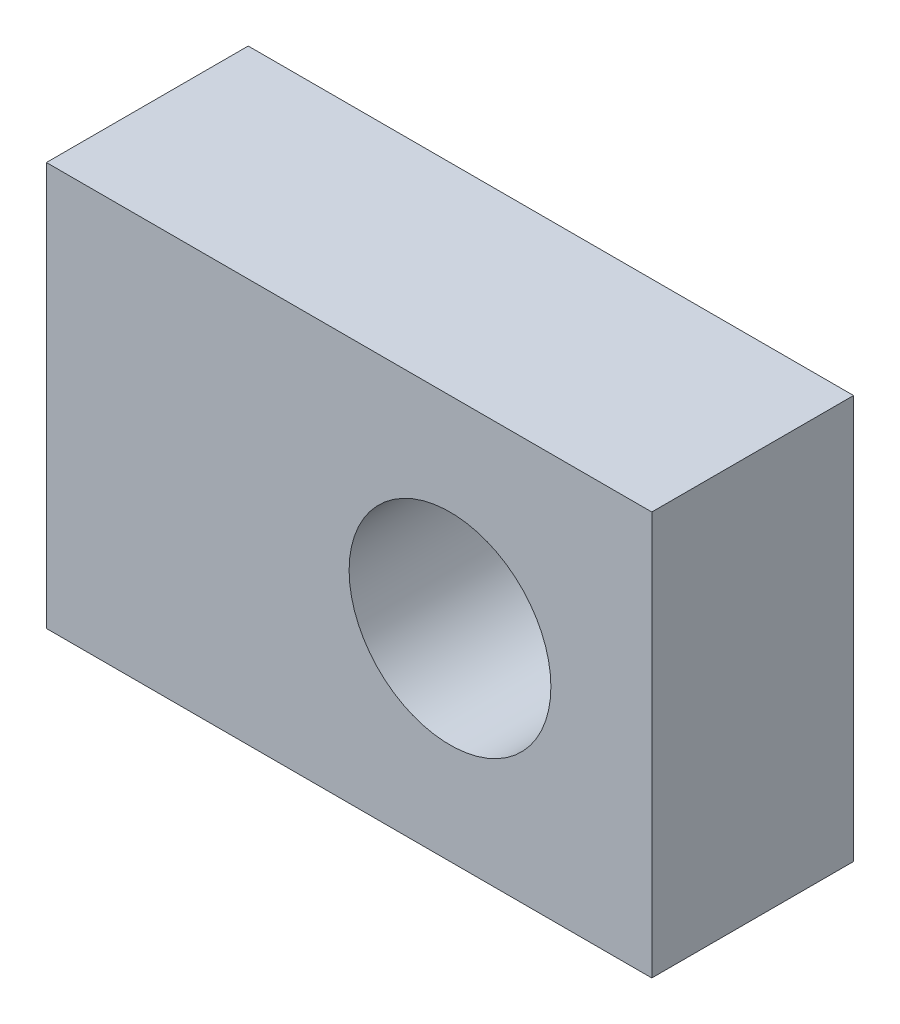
ISO-10303-21;
HEADER;
FILE_DESCRIPTION(('STEP AP214'),'2;1');
FILE_NAME('part.step','',(''),(''),'','','');
FILE_SCHEMA(('AUTOMOTIVE_DESIGN { 1 0 10303 214 1 1 1 1 }'));
ENDSEC;
DATA;
#1=APPLICATION_CONTEXT('core data for automotive mechanical design processes');
#2=APPLICATION_PROTOCOL_DEFINITION('international standard','automotive_design',2000,#1);
#3=PRODUCT_CONTEXT('',#1,'mechanical');
#4=PRODUCT('Part','Part','',(#3));
#5=PRODUCT_RELATED_PRODUCT_CATEGORY('part','',(#4));
#6=PRODUCT_DEFINITION_FORMATION('','',#4);
#7=PRODUCT_DEFINITION_CONTEXT('part definition',#1,'design');
#8=PRODUCT_DEFINITION('design','',#6,#7);
#9=PRODUCT_DEFINITION_SHAPE('','',#8);
#10=(LENGTH_UNIT() NAMED_UNIT(*) SI_UNIT(.MILLI.,.METRE.));
#11=(NAMED_UNIT(*) PLANE_ANGLE_UNIT() SI_UNIT($,.RADIAN.));
#12=(NAMED_UNIT(*) SI_UNIT($,.STERADIAN.) SOLID_ANGLE_UNIT());
#13=UNCERTAINTY_MEASURE_WITH_UNIT(LENGTH_MEASURE(1.E-05),#10,'distance_accuracy_value','');
#14=(GEOMETRIC_REPRESENTATION_CONTEXT(3) GLOBAL_UNCERTAINTY_ASSIGNED_CONTEXT((#13)) GLOBAL_UNIT_ASSIGNED_CONTEXT((#10,
#11,#12)) REPRESENTATION_CONTEXT('',''));
#15=CARTESIAN_POINT('',(0.,0.,0.));
#16=DIRECTION('',(0.,0.,1.));
#17=DIRECTION('',(1.,0.,0.));
#18=AXIS2_PLACEMENT_3D('',#15,#16,#17);
#19=CARTESIAN_POINT('',(10.865660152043,-8.20939430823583,12.7));
#20=DIRECTION('',(0.,0.,1.));
#21=DIRECTION('',(1.,0.,0.));
#22=AXIS2_PLACEMENT_3D('',#19,#20,#21);
#23=PLANE('',#22);
#24=DIRECTION('',(0.,-1.,0.));
#25=VECTOR('',#24,1.);
#26=CARTESIAN_POINT('',(10.865660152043,17.1906056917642,12.7));
#27=LINE('',#26,#25);
#28=CARTESIAN_POINT('',(10.865660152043,17.1906056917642,12.7));
#29=VERTEX_POINT('',#28);
#30=CARTESIAN_POINT('',(10.865660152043,-8.20939430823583,12.7));
#31=VERTEX_POINT('',#30);
#32=EDGE_CURVE('E83',#29,#31,#27,.T.);
#33=ORIENTED_EDGE('',*,*,#32,.T.);
#34=DIRECTION('',(1.,0.,0.));
#35=VECTOR('',#34,1.);
#36=CARTESIAN_POINT('',(10.865660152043,-8.20939430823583,12.7));
#37=LINE('',#36,#35);
#38=CARTESIAN_POINT('',(48.965660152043,-8.20939430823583,12.7));
#39=VERTEX_POINT('',#38);
#40=EDGE_CURVE('E78',#31,#39,#37,.T.);
#41=ORIENTED_EDGE('',*,*,#40,.T.);
#42=DIRECTION('',(0.,1.,0.));
#43=VECTOR('',#42,1.);
#44=CARTESIAN_POINT('',(48.965660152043,17.1906056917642,12.7));
#45=LINE('',#44,#43);
#46=CARTESIAN_POINT('',(48.965660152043,17.1906056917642,12.7));
#47=VERTEX_POINT('',#46);
#48=EDGE_CURVE('E81',#39,#47,#45,.T.);
#49=ORIENTED_EDGE('',*,*,#48,.T.);
#50=DIRECTION('',(-1.,0.,0.));
#51=VECTOR('',#50,1.);
#52=CARTESIAN_POINT('',(10.865660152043,17.1906056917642,12.7));
#53=LINE('',#52,#51);
#54=EDGE_CURVE('E48',#47,#29,#53,.T.);
#55=ORIENTED_EDGE('',*,*,#54,.T.);
#56=EDGE_LOOP('',(#33,#41,#49,#55));
#57=FACE_BOUND('',#56,.T.);
#58=CARTESIAN_POINT('',(36.265660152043,4.49060569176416,12.7));
#59=DIRECTION('',(0.,0.,1.));
#60=DIRECTION('',(1.,0.,0.));
#61=AXIS2_PLACEMENT_3D('',#58,#59,#60);
#62=CIRCLE('',#61,6.35);
#63=CARTESIAN_POINT('',(42.615660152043,4.49060569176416,12.7));
#64=VERTEX_POINT('',#63);
#65=EDGE_CURVE('E98',#64,#64,#62,.T.);
#66=ORIENTED_EDGE('',*,*,#65,.F.);
#67=EDGE_LOOP('',(#66));
#68=FACE_BOUND('',#67,.T.);
#69=ADVANCED_FACE('F31',(#57,#68),#23,.T.);
#70=CARTESIAN_POINT('',(10.865660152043,-8.20939430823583,0.));
#71=DIRECTION('',(0.,0.,1.));
#72=DIRECTION('',(1.,0.,0.));
#73=AXIS2_PLACEMENT_3D('',#70,#71,#72);
#74=PLANE('',#73);
#75=DIRECTION('',(0.,-1.,0.));
#76=VECTOR('',#75,1.);
#77=CARTESIAN_POINT('',(10.865660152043,17.1906056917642,0.));
#78=LINE('',#77,#76);
#79=CARTESIAN_POINT('',(10.865660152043,17.1906056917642,0.));
#80=VERTEX_POINT('',#79);
#81=CARTESIAN_POINT('',(10.865660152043,-8.20939430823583,0.));
#82=VERTEX_POINT('',#81);
#83=EDGE_CURVE('E95',#80,#82,#78,.T.);
#84=ORIENTED_EDGE('',*,*,#83,.F.);
#85=DIRECTION('',(-1.,0.,0.));
#86=VECTOR('',#85,1.);
#87=CARTESIAN_POINT('',(10.865660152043,17.1906056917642,0.));
#88=LINE('',#87,#86);
#89=CARTESIAN_POINT('',(48.965660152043,17.1906056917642,0.));
#90=VERTEX_POINT('',#89);
#91=EDGE_CURVE('E71',#90,#80,#88,.T.);
#92=ORIENTED_EDGE('',*,*,#91,.F.);
#93=DIRECTION('',(0.,1.,0.));
#94=VECTOR('',#93,1.);
#95=CARTESIAN_POINT('',(48.965660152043,17.1906056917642,0.));
#96=LINE('',#95,#94);
#97=CARTESIAN_POINT('',(48.965660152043,-8.20939430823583,0.));
#98=VERTEX_POINT('',#97);
#99=EDGE_CURVE('E65',#98,#90,#96,.T.);
#100=ORIENTED_EDGE('',*,*,#99,.F.);
#101=DIRECTION('',(1.,0.,0.));
#102=VECTOR('',#101,1.);
#103=CARTESIAN_POINT('',(10.865660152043,-8.20939430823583,0.));
#104=LINE('',#103,#102);
#105=EDGE_CURVE('E87',#82,#98,#104,.T.);
#106=ORIENTED_EDGE('',*,*,#105,.F.);
#107=EDGE_LOOP('',(#84,#92,#100,#106));
#108=FACE_BOUND('',#107,.T.);
#109=CARTESIAN_POINT('',(36.265660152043,4.49060569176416,0.));
#110=DIRECTION('',(0.,0.,1.));
#111=DIRECTION('',(1.,0.,0.));
#112=AXIS2_PLACEMENT_3D('',#109,#110,#111);
#113=CIRCLE('',#112,6.35);
#114=CARTESIAN_POINT('',(42.615660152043,4.49060569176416,0.));
#115=VERTEX_POINT('',#114);
#116=EDGE_CURVE('E110',#115,#115,#113,.T.);
#117=ORIENTED_EDGE('',*,*,#116,.T.);
#118=EDGE_LOOP('',(#117));
#119=FACE_BOUND('',#118,.T.);
#120=ADVANCED_FACE('F106',(#108,#119),#74,.F.);
#121=CARTESIAN_POINT('',(10.865660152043,17.1906056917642,12.7));
#122=DIRECTION('',(1.,0.,0.));
#123=DIRECTION('',(0.,1.,0.));
#124=AXIS2_PLACEMENT_3D('',#121,#122,#123);
#125=PLANE('',#124);
#126=ORIENTED_EDGE('',*,*,#83,.T.);
#127=DIRECTION('',(0.,0.,-1.));
#128=VECTOR('',#127,1.);
#129=CARTESIAN_POINT('',(10.865660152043,-8.20939430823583,12.7));
#130=LINE('',#129,#128);
#131=EDGE_CURVE('E11',#31,#82,#130,.T.);
#132=ORIENTED_EDGE('',*,*,#131,.F.);
#133=ORIENTED_EDGE('',*,*,#32,.F.);
#134=DIRECTION('',(0.,0.,-1.));
#135=VECTOR('',#134,1.);
#136=CARTESIAN_POINT('',(10.865660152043,17.1906056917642,12.7));
#137=LINE('',#136,#135);
#138=EDGE_CURVE('E91',#29,#80,#137,.T.);
#139=ORIENTED_EDGE('',*,*,#138,.T.);
#140=EDGE_LOOP('',(#126,#132,#133,#139));
#141=FACE_BOUND('',#140,.T.);
#142=ADVANCED_FACE('F33',(#141),#125,.F.);
#143=CARTESIAN_POINT('',(10.865660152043,-8.20939430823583,12.7));
#144=DIRECTION('',(0.,1.,0.));
#145=DIRECTION('',(0.,0.,1.));
#146=AXIS2_PLACEMENT_3D('',#143,#144,#145);
#147=PLANE('',#146);
#148=ORIENTED_EDGE('',*,*,#105,.T.);
#149=DIRECTION('',(0.,0.,-1.));
#150=VECTOR('',#149,1.);
#151=CARTESIAN_POINT('',(48.965660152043,-8.20939430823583,12.7));
#152=LINE('',#151,#150);
#153=EDGE_CURVE('E40',#39,#98,#152,.T.);
#154=ORIENTED_EDGE('',*,*,#153,.F.);
#155=ORIENTED_EDGE('',*,*,#40,.F.);
#156=ORIENTED_EDGE('',*,*,#131,.T.);
#157=EDGE_LOOP('',(#148,#154,#155,#156));
#158=FACE_BOUND('',#157,.T.);
#159=ADVANCED_FACE('F86',(#158),#147,.F.);
#160=CARTESIAN_POINT('',(48.965660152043,17.1906056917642,12.7));
#161=DIRECTION('',(-1.,0.,0.));
#162=DIRECTION('',(0.,0.,1.));
#163=AXIS2_PLACEMENT_3D('',#160,#161,#162);
#164=PLANE('',#163);
#165=ORIENTED_EDGE('',*,*,#99,.T.);
#166=DIRECTION('',(0.,0.,-1.));
#167=VECTOR('',#166,1.);
#168=CARTESIAN_POINT('',(48.965660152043,17.1906056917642,12.7));
#169=LINE('',#168,#167);
#170=EDGE_CURVE('E88',#47,#90,#169,.T.);
#171=ORIENTED_EDGE('',*,*,#170,.F.);
#172=ORIENTED_EDGE('',*,*,#48,.F.);
#173=ORIENTED_EDGE('',*,*,#153,.T.);
#174=EDGE_LOOP('',(#165,#171,#172,#173));
#175=FACE_BOUND('',#174,.T.);
#176=ADVANCED_FACE('F89',(#175),#164,.F.);
#177=CARTESIAN_POINT('',(10.865660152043,17.1906056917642,12.7));
#178=DIRECTION('',(0.,-1.,0.));
#179=DIRECTION('',(0.,0.,-1.));
#180=AXIS2_PLACEMENT_3D('',#177,#178,#179);
#181=PLANE('',#180);
#182=ORIENTED_EDGE('',*,*,#91,.T.);
#183=ORIENTED_EDGE('',*,*,#138,.F.);
#184=ORIENTED_EDGE('',*,*,#54,.F.);
#185=ORIENTED_EDGE('',*,*,#170,.T.);
#186=EDGE_LOOP('',(#182,#183,#184,#185));
#187=FACE_BOUND('',#186,.T.);
#188=ADVANCED_FACE('F103',(#187),#181,.F.);
#189=CARTESIAN_POINT('',(36.265660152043,4.49060569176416,12.7));
#190=DIRECTION('',(0.,0.,-1.));
#191=DIRECTION('',(-1.,0.,0.));
#192=AXIS2_PLACEMENT_3D('',#189,#190,#191);
#193=CYLINDRICAL_SURFACE('',#192,6.35);
#194=ORIENTED_EDGE('',*,*,#65,.T.);
#195=EDGE_LOOP('',(#194));
#196=FACE_BOUND('',#195,.T.);
#197=ORIENTED_EDGE('',*,*,#116,.F.);
#198=EDGE_LOOP('',(#197));
#199=FACE_BOUND('',#198,.T.);
#200=ADVANCED_FACE('F116',(#196,#199),#193,.F.);
#201=CLOSED_SHELL('',(#69,#120,#142,#159,#176,#188,#200));
#202=MANIFOLD_SOLID_BREP('B2',#201);
#203=ADVANCED_BREP_SHAPE_REPRESENTATION('',(#18,#202),#14);
#204=SHAPE_DEFINITION_REPRESENTATION(#9,#203);
ENDSEC;
END-ISO-10303-21;
